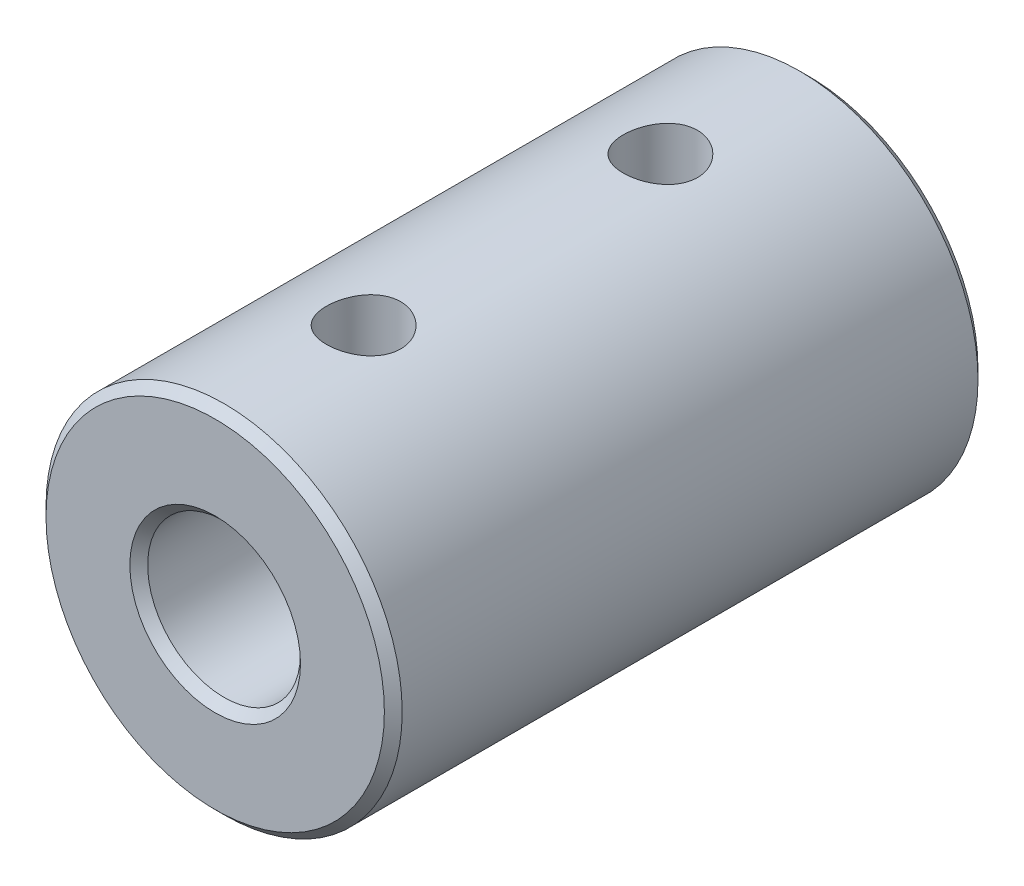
from build123d import *

# Parameters (mm, degrees)
ESQUISSE1_R             = 6
ESQUISSE1_R_2           = 2.075
BOSS_EXTRU_1_DEPTH      = 10
ESQUISSE2_R             = 2.575
ENL_V_MAT_EXTRU_1_DEPTH = 10
ESQUISSE3_R             = 1.25
ENL_V_MAT_EXTRU_2_DEPTH = 6
CHANFREIN1_SIZE         = 0.3


with BuildPart() as part:
    # Esquisse1 → Boss.-Extru.1 (new, symmetric)
    with BuildSketch(Plane.XY):
        Circle(ESQUISSE1_R)
        Circle(ESQUISSE1_R_2, mode=Mode.SUBTRACT)
    extrude(amount=BOSS_EXTRU_1_DEPTH, both=True)

    # Esquisse2 → Enl_v. mat.-Extru.1 (cut)
    with BuildSketch(Plane.XY.offset(10)):
        Circle(ESQUISSE2_R)
    extrude(amount=-ENL_V_MAT_EXTRU_1_DEPTH, mode=Mode.SUBTRACT)

    # Esquisse3 → Enl_v. mat.-Extru.2 (cut, symmetric)
    with BuildSketch(Plane(origin=(0, 0, 0), x_dir=(-1, 0, 0), z_dir=(0, 1, 0))):
        with Locations(Location((0, 5, 0), (0, 0, 90))):
            Circle(ESQUISSE3_R)
        with Locations(Location((0, -5, 0), (0, 0, 90))):
            Circle(ESQUISSE3_R)
    extrude(amount=ENL_V_MAT_EXTRU_2_DEPTH, both=True, mode=Mode.SUBTRACT)

    # Chanfrein1
    chanfrein1_edges = [part.edges().sort_by_distance(p)[0] for p in [
        (-2.575, 0, 10),
        (-6, 0, -10),
        (-6, 0, 10),
        (-2.075, 0, -10),
    ]]
    chamfer(chanfrein1_edges, length=CHANFREIN1_SIZE)


solid = part.part
